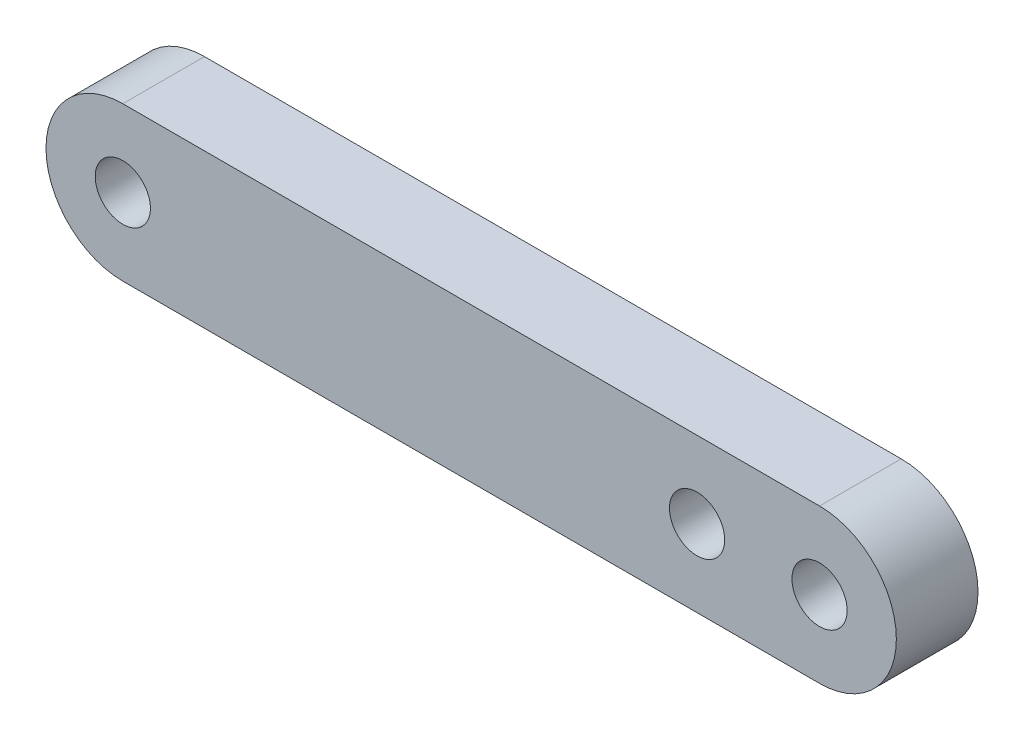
ISO-10303-21;
HEADER;
FILE_DESCRIPTION(('STEP AP214'),'2;1');
FILE_NAME('part.step','',(''),(''),'','','');
FILE_SCHEMA(('AUTOMOTIVE_DESIGN { 1 0 10303 214 1 1 1 1 }'));
ENDSEC;
DATA;
#1=APPLICATION_CONTEXT('core data for automotive mechanical design processes');
#2=APPLICATION_PROTOCOL_DEFINITION('international standard','automotive_design',2000,#1);
#3=PRODUCT_CONTEXT('',#1,'mechanical');
#4=PRODUCT('Part','Part','',(#3));
#5=PRODUCT_RELATED_PRODUCT_CATEGORY('part','',(#4));
#6=PRODUCT_DEFINITION_FORMATION('','',#4);
#7=PRODUCT_DEFINITION_CONTEXT('part definition',#1,'design');
#8=PRODUCT_DEFINITION('design','',#6,#7);
#9=PRODUCT_DEFINITION_SHAPE('','',#8);
#10=(LENGTH_UNIT() NAMED_UNIT(*) SI_UNIT(.MILLI.,.METRE.));
#11=(NAMED_UNIT(*) PLANE_ANGLE_UNIT() SI_UNIT($,.RADIAN.));
#12=(NAMED_UNIT(*) SI_UNIT($,.STERADIAN.) SOLID_ANGLE_UNIT());
#13=UNCERTAINTY_MEASURE_WITH_UNIT(LENGTH_MEASURE(1.E-05),#10,'distance_accuracy_value','');
#14=(GEOMETRIC_REPRESENTATION_CONTEXT(3) GLOBAL_UNCERTAINTY_ASSIGNED_CONTEXT((#13)) GLOBAL_UNIT_ASSIGNED_CONTEXT((#10,
#11,#12)) REPRESENTATION_CONTEXT('',''));
#15=CARTESIAN_POINT('',(0.,0.,0.));
#16=DIRECTION('',(0.,0.,1.));
#17=DIRECTION('',(1.,0.,0.));
#18=AXIS2_PLACEMENT_3D('',#15,#16,#17);
#19=CARTESIAN_POINT('',(0.,0.,203.2));
#20=DIRECTION('',(0.,0.,1.));
#21=DIRECTION('',(1.,0.,0.));
#22=AXIS2_PLACEMENT_3D('',#19,#20,#21);
#23=PLANE('',#22);
#24=CARTESIAN_POINT('',(1734.,0.,203.2));
#25=DIRECTION('',(0.,0.,1.));
#26=DIRECTION('',(1.,0.,0.));
#27=AXIS2_PLACEMENT_3D('',#24,#25,#26);
#28=CIRCLE('',#27,68.6902978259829);
#29=CARTESIAN_POINT('',(1802.69029782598,0.,203.2));
#30=VERTEX_POINT('',#29);
#31=EDGE_CURVE('E114',#30,#30,#28,.T.);
#32=ORIENTED_EDGE('',*,*,#31,.F.);
#33=EDGE_LOOP('',(#32));
#34=FACE_BOUND('',#33,.T.);
#35=CARTESIAN_POINT('',(0.,0.,203.2));
#36=DIRECTION('',(0.,0.,1.));
#37=DIRECTION('',(1.,0.,0.));
#38=AXIS2_PLACEMENT_3D('',#35,#36,#37);
#39=CIRCLE('',#38,191.219678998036);
#40=CARTESIAN_POINT('',(0.,191.219678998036,203.2));
#41=VERTEX_POINT('',#40);
#42=CARTESIAN_POINT('',(0.,-191.219678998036,203.2));
#43=VERTEX_POINT('',#42);
#44=EDGE_CURVE('E84',#41,#43,#39,.T.);
#45=ORIENTED_EDGE('',*,*,#44,.T.);
#46=DIRECTION('',(1.,0.,0.));
#47=VECTOR('',#46,1.);
#48=CARTESIAN_POINT('',(0.,-191.219678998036,203.2));
#49=LINE('',#48,#47);
#50=CARTESIAN_POINT('',(1734.,-191.219678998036,203.2));
#51=VERTEX_POINT('',#50);
#52=EDGE_CURVE('E79',#43,#51,#49,.T.);
#53=ORIENTED_EDGE('',*,*,#52,.T.);
#54=CARTESIAN_POINT('',(1734.,0.,203.2));
#55=DIRECTION('',(0.,0.,1.));
#56=DIRECTION('',(1.,0.,0.));
#57=AXIS2_PLACEMENT_3D('',#54,#55,#56);
#58=CIRCLE('',#57,191.219678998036);
#59=CARTESIAN_POINT('',(1734.,191.219678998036,203.2));
#60=VERTEX_POINT('',#59);
#61=EDGE_CURVE('E82',#51,#60,#58,.T.);
#62=ORIENTED_EDGE('',*,*,#61,.T.);
#63=DIRECTION('',(-1.,0.,0.));
#64=VECTOR('',#63,1.);
#65=CARTESIAN_POINT('',(0.,191.219678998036,203.2));
#66=LINE('',#65,#64);
#67=EDGE_CURVE('E49',#60,#41,#66,.T.);
#68=ORIENTED_EDGE('',*,*,#67,.T.);
#69=EDGE_LOOP('',(#45,#53,#62,#68));
#70=FACE_BOUND('',#69,.T.);
#71=CARTESIAN_POINT('',(0.,0.,203.2));
#72=DIRECTION('',(0.,0.,1.));
#73=DIRECTION('',(1.,0.,0.));
#74=AXIS2_PLACEMENT_3D('',#71,#72,#73);
#75=CIRCLE('',#74,68.6902978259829);
#76=CARTESIAN_POINT('',(68.6902978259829,0.,203.2));
#77=VERTEX_POINT('',#76);
#78=EDGE_CURVE('E99',#77,#77,#75,.T.);
#79=ORIENTED_EDGE('',*,*,#78,.F.);
#80=EDGE_LOOP('',(#79));
#81=FACE_BOUND('',#80,.T.);
#82=CARTESIAN_POINT('',(1429.2,0.,203.2));
#83=DIRECTION('',(0.,0.,1.));
#84=DIRECTION('',(1.,0.,0.));
#85=AXIS2_PLACEMENT_3D('',#82,#83,#84);
#86=CIRCLE('',#85,68.6902978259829);
#87=CARTESIAN_POINT('',(1497.89029782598,0.,203.2));
#88=VERTEX_POINT('',#87);
#89=EDGE_CURVE('E120',#88,#88,#86,.T.);
#90=ORIENTED_EDGE('',*,*,#89,.F.);
#91=EDGE_LOOP('',(#90));
#92=FACE_BOUND('',#91,.T.);
#93=ADVANCED_FACE('F32',(#34,#70,#81,#92),#23,.T.);
#94=CARTESIAN_POINT('',(0.,0.,0.));
#95=DIRECTION('',(0.,0.,1.));
#96=DIRECTION('',(1.,0.,0.));
#97=AXIS2_PLACEMENT_3D('',#94,#95,#96);
#98=PLANE('',#97);
#99=CARTESIAN_POINT('',(1734.,0.,0.));
#100=DIRECTION('',(0.,0.,1.));
#101=DIRECTION('',(1.,0.,0.));
#102=AXIS2_PLACEMENT_3D('',#99,#100,#101);
#103=CIRCLE('',#102,68.6902978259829);
#104=CARTESIAN_POINT('',(1802.69029782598,0.,0.));
#105=VERTEX_POINT('',#104);
#106=EDGE_CURVE('E117',#105,#105,#103,.T.);
#107=ORIENTED_EDGE('',*,*,#106,.T.);
#108=EDGE_LOOP('',(#107));
#109=FACE_BOUND('',#108,.T.);
#110=CARTESIAN_POINT('',(0.,0.,0.));
#111=DIRECTION('',(0.,0.,1.));
#112=DIRECTION('',(1.,0.,0.));
#113=AXIS2_PLACEMENT_3D('',#110,#111,#112);
#114=CIRCLE('',#113,191.219678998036);
#115=CARTESIAN_POINT('',(0.,191.219678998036,0.));
#116=VERTEX_POINT('',#115);
#117=CARTESIAN_POINT('',(0.,-191.219678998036,0.));
#118=VERTEX_POINT('',#117);
#119=EDGE_CURVE('E96',#116,#118,#114,.T.);
#120=ORIENTED_EDGE('',*,*,#119,.F.);
#121=DIRECTION('',(-1.,0.,0.));
#122=VECTOR('',#121,1.);
#123=CARTESIAN_POINT('',(0.,191.219678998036,0.));
#124=LINE('',#123,#122);
#125=CARTESIAN_POINT('',(1734.,191.219678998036,0.));
#126=VERTEX_POINT('',#125);
#127=EDGE_CURVE('E72',#126,#116,#124,.T.);
#128=ORIENTED_EDGE('',*,*,#127,.F.);
#129=CARTESIAN_POINT('',(1734.,0.,0.));
#130=DIRECTION('',(0.,0.,1.));
#131=DIRECTION('',(1.,0.,0.));
#132=AXIS2_PLACEMENT_3D('',#129,#130,#131);
#133=CIRCLE('',#132,191.219678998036);
#134=CARTESIAN_POINT('',(1734.,-191.219678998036,0.));
#135=VERTEX_POINT('',#134);
#136=EDGE_CURVE('E66',#135,#126,#133,.T.);
#137=ORIENTED_EDGE('',*,*,#136,.F.);
#138=DIRECTION('',(1.,0.,0.));
#139=VECTOR('',#138,1.);
#140=CARTESIAN_POINT('',(0.,-191.219678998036,0.));
#141=LINE('',#140,#139);
#142=EDGE_CURVE('E88',#118,#135,#141,.T.);
#143=ORIENTED_EDGE('',*,*,#142,.F.);
#144=EDGE_LOOP('',(#120,#128,#137,#143));
#145=FACE_BOUND('',#144,.T.);
#146=CARTESIAN_POINT('',(0.,0.,0.));
#147=DIRECTION('',(0.,0.,1.));
#148=DIRECTION('',(1.,0.,0.));
#149=AXIS2_PLACEMENT_3D('',#146,#147,#148);
#150=CIRCLE('',#149,68.6902978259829);
#151=CARTESIAN_POINT('',(68.6902978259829,0.,0.));
#152=VERTEX_POINT('',#151);
#153=EDGE_CURVE('E111',#152,#152,#150,.T.);
#154=ORIENTED_EDGE('',*,*,#153,.T.);
#155=EDGE_LOOP('',(#154));
#156=FACE_BOUND('',#155,.T.);
#157=CARTESIAN_POINT('',(1429.2,0.,0.));
#158=DIRECTION('',(0.,0.,1.));
#159=DIRECTION('',(1.,0.,0.));
#160=AXIS2_PLACEMENT_3D('',#157,#158,#159);
#161=CIRCLE('',#160,68.6902978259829);
#162=CARTESIAN_POINT('',(1497.89029782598,0.,0.));
#163=VERTEX_POINT('',#162);
#164=EDGE_CURVE('E123',#163,#163,#161,.T.);
#165=ORIENTED_EDGE('',*,*,#164,.T.);
#166=EDGE_LOOP('',(#165));
#167=FACE_BOUND('',#166,.T.);
#168=ADVANCED_FACE('F107',(#109,#145,#156,#167),#98,.F.);
#169=CARTESIAN_POINT('',(0.,0.,203.2));
#170=DIRECTION('',(0.,0.,-1.));
#171=DIRECTION('',(-1.,0.,0.));
#172=AXIS2_PLACEMENT_3D('',#169,#170,#171);
#173=CYLINDRICAL_SURFACE('',#172,191.219678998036);
#174=ORIENTED_EDGE('',*,*,#119,.T.);
#175=DIRECTION('',(0.,0.,-1.));
#176=VECTOR('',#175,1.);
#177=CARTESIAN_POINT('',(0.,-191.219678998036,203.2));
#178=LINE('',#177,#176);
#179=EDGE_CURVE('E11',#43,#118,#178,.T.);
#180=ORIENTED_EDGE('',*,*,#179,.F.);
#181=ORIENTED_EDGE('',*,*,#44,.F.);
#182=DIRECTION('',(0.,0.,-1.));
#183=VECTOR('',#182,1.);
#184=CARTESIAN_POINT('',(0.,191.219678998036,203.2));
#185=LINE('',#184,#183);
#186=EDGE_CURVE('E92',#41,#116,#185,.T.);
#187=ORIENTED_EDGE('',*,*,#186,.T.);
#188=EDGE_LOOP('',(#174,#180,#181,#187));
#189=FACE_BOUND('',#188,.T.);
#190=ADVANCED_FACE('F34',(#189),#173,.T.);
#191=CARTESIAN_POINT('',(0.,-191.219678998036,203.2));
#192=DIRECTION('',(0.,1.,0.));
#193=DIRECTION('',(0.,0.,1.));
#194=AXIS2_PLACEMENT_3D('',#191,#192,#193);
#195=PLANE('',#194);
#196=ORIENTED_EDGE('',*,*,#142,.T.);
#197=DIRECTION('',(0.,0.,-1.));
#198=VECTOR('',#197,1.);
#199=CARTESIAN_POINT('',(1734.,-191.219678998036,203.2));
#200=LINE('',#199,#198);
#201=EDGE_CURVE('E41',#51,#135,#200,.T.);
#202=ORIENTED_EDGE('',*,*,#201,.F.);
#203=ORIENTED_EDGE('',*,*,#52,.F.);
#204=ORIENTED_EDGE('',*,*,#179,.T.);
#205=EDGE_LOOP('',(#196,#202,#203,#204));
#206=FACE_BOUND('',#205,.T.);
#207=ADVANCED_FACE('F87',(#206),#195,.F.);
#208=CARTESIAN_POINT('',(1734.,0.,203.2));
#209=DIRECTION('',(0.,0.,-1.));
#210=DIRECTION('',(-1.,0.,0.));
#211=AXIS2_PLACEMENT_3D('',#208,#209,#210);
#212=CYLINDRICAL_SURFACE('',#211,191.219678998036);
#213=ORIENTED_EDGE('',*,*,#136,.T.);
#214=DIRECTION('',(0.,0.,-1.));
#215=VECTOR('',#214,1.);
#216=CARTESIAN_POINT('',(1734.,191.219678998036,203.2));
#217=LINE('',#216,#215);
#218=EDGE_CURVE('E89',#60,#126,#217,.T.);
#219=ORIENTED_EDGE('',*,*,#218,.F.);
#220=ORIENTED_EDGE('',*,*,#61,.F.);
#221=ORIENTED_EDGE('',*,*,#201,.T.);
#222=EDGE_LOOP('',(#213,#219,#220,#221));
#223=FACE_BOUND('',#222,.T.);
#224=ADVANCED_FACE('F90',(#223),#212,.T.);
#225=CARTESIAN_POINT('',(0.,191.219678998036,203.2));
#226=DIRECTION('',(0.,-1.,0.));
#227=DIRECTION('',(0.,0.,-1.));
#228=AXIS2_PLACEMENT_3D('',#225,#226,#227);
#229=PLANE('',#228);
#230=ORIENTED_EDGE('',*,*,#127,.T.);
#231=ORIENTED_EDGE('',*,*,#186,.F.);
#232=ORIENTED_EDGE('',*,*,#67,.F.);
#233=ORIENTED_EDGE('',*,*,#218,.T.);
#234=EDGE_LOOP('',(#230,#231,#232,#233));
#235=FACE_BOUND('',#234,.T.);
#236=ADVANCED_FACE('F104',(#235),#229,.F.);
#237=CARTESIAN_POINT('',(0.,0.,203.2));
#238=DIRECTION('',(0.,0.,-1.));
#239=DIRECTION('',(-1.,0.,0.));
#240=AXIS2_PLACEMENT_3D('',#237,#238,#239);
#241=CYLINDRICAL_SURFACE('',#240,68.6902978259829);
#242=ORIENTED_EDGE('',*,*,#78,.T.);
#243=EDGE_LOOP('',(#242));
#244=FACE_BOUND('',#243,.T.);
#245=ORIENTED_EDGE('',*,*,#153,.F.);
#246=EDGE_LOOP('',(#245));
#247=FACE_BOUND('',#246,.T.);
#248=ADVANCED_FACE('F142',(#244,#247),#241,.F.);
#249=CARTESIAN_POINT('',(1734.,0.,203.2));
#250=DIRECTION('',(0.,0.,-1.));
#251=DIRECTION('',(-1.,0.,0.));
#252=AXIS2_PLACEMENT_3D('',#249,#250,#251);
#253=CYLINDRICAL_SURFACE('',#252,68.6902978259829);
#254=ORIENTED_EDGE('',*,*,#31,.T.);
#255=EDGE_LOOP('',(#254));
#256=FACE_BOUND('',#255,.T.);
#257=ORIENTED_EDGE('',*,*,#106,.F.);
#258=EDGE_LOOP('',(#257));
#259=FACE_BOUND('',#258,.T.);
#260=ADVANCED_FACE('F188',(#256,#259),#253,.F.);
#261=CARTESIAN_POINT('',(1429.2,0.,203.2));
#262=DIRECTION('',(0.,0.,-1.));
#263=DIRECTION('',(-1.,0.,0.));
#264=AXIS2_PLACEMENT_3D('',#261,#262,#263);
#265=CYLINDRICAL_SURFACE('',#264,68.6902978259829);
#266=ORIENTED_EDGE('',*,*,#89,.T.);
#267=EDGE_LOOP('',(#266));
#268=FACE_BOUND('',#267,.T.);
#269=ORIENTED_EDGE('',*,*,#164,.F.);
#270=EDGE_LOOP('',(#269));
#271=FACE_BOUND('',#270,.T.);
#272=ADVANCED_FACE('F129',(#268,#271),#265,.F.);
#273=CLOSED_SHELL('',(#93,#168,#190,#207,#224,#236,#248,#260,#272));
#274=MANIFOLD_SOLID_BREP('B2',#273);
#275=ADVANCED_BREP_SHAPE_REPRESENTATION('',(#18,#274),#14);
#276=SHAPE_DEFINITION_REPRESENTATION(#9,#275);
ENDSEC;
END-ISO-10303-21;
